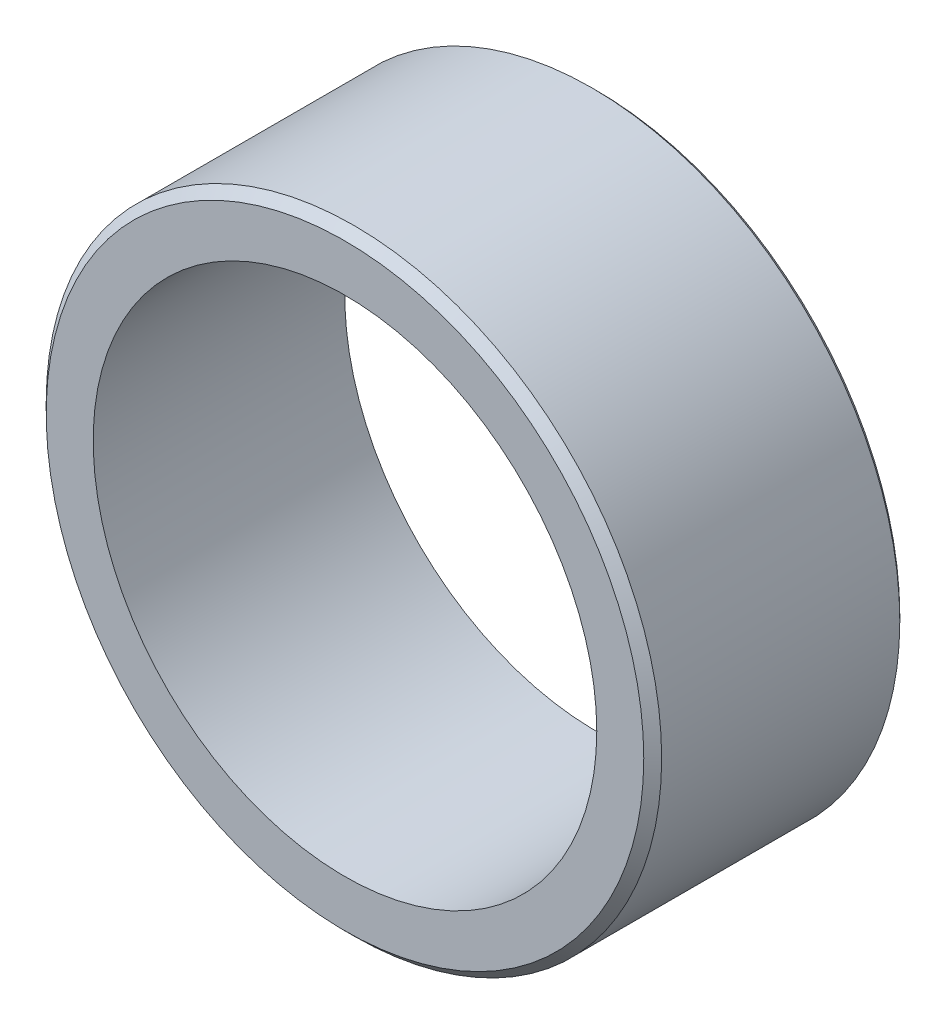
from build123d import *

# Parameters (mm, degrees)
SKETCH1_R      = 17.4625
SKETCH1_R_2    = 14.2875
EXTRUDE1_DEPTH = 7.1374
CHAMFER1_SIZE  = 0.508
CHAMFER2_SIZE  = 0.254


with BuildPart() as part:
    # Sketch1 → Extrude1 (new, symmetric)
    with BuildSketch(Plane.XY):
        Circle(SKETCH1_R)
        Circle(SKETCH1_R_2, mode=Mode.SUBTRACT)
    extrude(amount=EXTRUDE1_DEPTH, both=True)

    # Chamfer1
    chamfer1_edges = [part.edges().sort_by_distance(p)[0] for p in [
        (-17.4625, 0, 7.1374),
    ]]
    chamfer(chamfer1_edges, length=CHAMFER1_SIZE)

    # Chamfer2
    chamfer2_edges = [part.edges().sort_by_distance(p)[0] for p in [
        (-17.4625, 0, -7.1374),
    ]]
    chamfer(chamfer2_edges, length=CHAMFER2_SIZE)


solid = part.part
